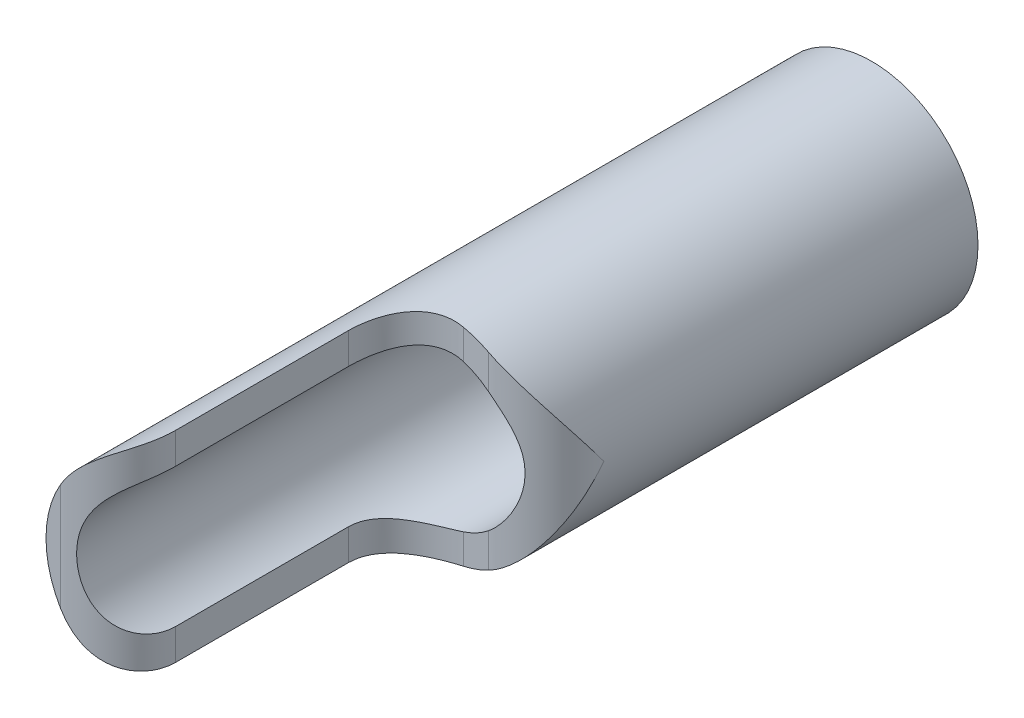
from build123d import *

# Parameters (mm, degrees)
SKETCH1_R               = 0.7375
SKETCH1_R_2             = 0.5375
BOSS_EXTRUDE1_DEPTH     = 5
CUT_EXTRUDE1_DEPTH      = 2
CUT_EXTRUDE1_DEPTH_BACK = 2


with BuildPart() as part:
    # Sketch1 → Boss-Extrude1 (new body)
    with BuildSketch(Plane.XY):
        Circle(SKETCH1_R)
        Circle(SKETCH1_R_2, mode=Mode.SUBTRACT)
    extrude(amount=BOSS_EXTRUDE1_DEPTH)

    # Sketch3 → Cut-Extrude1 (cut, two sides: drawn at the far end of the back side and taken through both)
    with BuildSketch(Plane(origin=(0, 0, 0), x_dir=(1, 0, 0), z_dir=(0, 1, 0)).offset(-CUT_EXTRUDE1_DEPTH_BACK)):
        with BuildLine():
            Line((-0.7375, -5), (-0.6375, -5))
            ThreePointArc((-0.6375, -5), (-0.354657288, -4.882842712), (-0.2375, -4.6))
            Line((-0.2375, -4.6), (-0.2375, -3.4))
            ThreePointArc((-0.2375, -3.4), (-0.120342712, -3.117157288), (0.1625, -3))
            Line((0.1625, -3), (0.3375, -3))
            ThreePointArc((0.3375, -3), (0.620342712, -2.882842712), (0.7375, -2.6))
            Line((0.7375, -2.6), (0.7375, -2.290424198))
            Line((0.7375, -2.290424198), (1.0406043, -2.290424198))
            Line((1.0406043, -2.290424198), (1.0406043, -5.289304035))
            Line((1.0406043, -5.289304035), (-0.7375, -5.289304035))
            Line((-0.7375, -5.289304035), (-0.7375, -5))
        make_face()
    extrude(amount=CUT_EXTRUDE1_DEPTH + CUT_EXTRUDE1_DEPTH_BACK, mode=Mode.SUBTRACT)


solid = part.part
